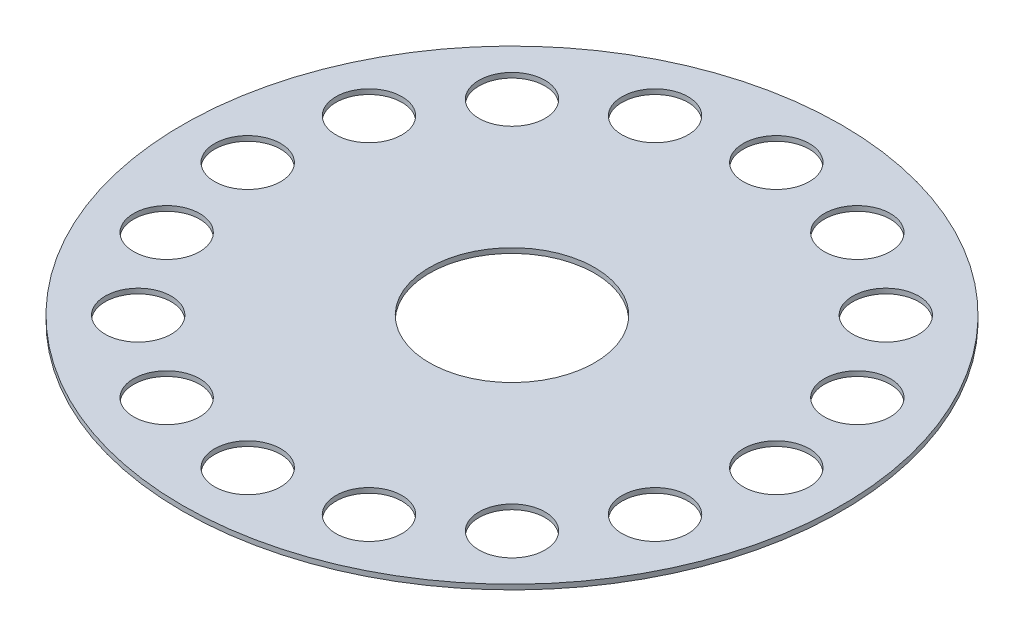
ISO-10303-21;
HEADER;
FILE_DESCRIPTION(('STEP AP214'),'2;1');
FILE_NAME('part.step','',(''),(''),'','','');
FILE_SCHEMA(('AUTOMOTIVE_DESIGN { 1 0 10303 214 1 1 1 1 }'));
ENDSEC;
DATA;
#1=APPLICATION_CONTEXT('core data for automotive mechanical design processes');
#2=APPLICATION_PROTOCOL_DEFINITION('international standard','automotive_design',2000,#1);
#3=PRODUCT_CONTEXT('',#1,'mechanical');
#4=PRODUCT('Part','Part','',(#3));
#5=PRODUCT_RELATED_PRODUCT_CATEGORY('part','',(#4));
#6=PRODUCT_DEFINITION_FORMATION('','',#4);
#7=PRODUCT_DEFINITION_CONTEXT('part definition',#1,'design');
#8=PRODUCT_DEFINITION('design','',#6,#7);
#9=PRODUCT_DEFINITION_SHAPE('','',#8);
#10=(LENGTH_UNIT() NAMED_UNIT(*) SI_UNIT(.MILLI.,.METRE.));
#11=(NAMED_UNIT(*) PLANE_ANGLE_UNIT() SI_UNIT($,.RADIAN.));
#12=(NAMED_UNIT(*) SI_UNIT($,.STERADIAN.) SOLID_ANGLE_UNIT());
#13=UNCERTAINTY_MEASURE_WITH_UNIT(LENGTH_MEASURE(1.E-05),#10,'distance_accuracy_value','');
#14=(GEOMETRIC_REPRESENTATION_CONTEXT(3) GLOBAL_UNCERTAINTY_ASSIGNED_CONTEXT((#13)) GLOBAL_UNIT_ASSIGNED_CONTEXT((#10,
#11,#12)) REPRESENTATION_CONTEXT('',''));
#15=CARTESIAN_POINT('',(0.,0.,0.));
#16=DIRECTION('',(0.,0.,1.));
#17=DIRECTION('',(1.,0.,0.));
#18=AXIS2_PLACEMENT_3D('',#15,#16,#17);
#19=CARTESIAN_POINT('',(0.,1.5,0.));
#20=DIRECTION('',(0.,-1.,0.));
#21=DIRECTION('',(0.,0.,-1.));
#22=AXIS2_PLACEMENT_3D('',#19,#20,#21);
#23=CYLINDRICAL_SURFACE('',#22,99.75);
#24=CARTESIAN_POINT('',(0.,1.5,0.));
#25=DIRECTION('',(0.,1.,0.));
#26=DIRECTION('',(0.,0.,1.));
#27=AXIS2_PLACEMENT_3D('',#24,#25,#26);
#28=CIRCLE('',#27,99.75);
#29=CARTESIAN_POINT('',(0.,1.5,99.75));
#30=VERTEX_POINT('',#29);
#31=EDGE_CURVE('E10',#30,#30,#28,.T.);
#32=ORIENTED_EDGE('',*,*,#31,.F.);
#33=EDGE_LOOP('',(#32));
#34=FACE_BOUND('',#33,.T.);
#35=CARTESIAN_POINT('',(0.,0.,0.));
#36=DIRECTION('',(0.,1.,0.));
#37=DIRECTION('',(0.,0.,1.));
#38=AXIS2_PLACEMENT_3D('',#35,#36,#37);
#39=CIRCLE('',#38,99.75);
#40=CARTESIAN_POINT('',(0.,0.,99.75));
#41=VERTEX_POINT('',#40);
#42=EDGE_CURVE('E34',#41,#41,#39,.T.);
#43=ORIENTED_EDGE('',*,*,#42,.T.);
#44=EDGE_LOOP('',(#43));
#45=FACE_BOUND('',#44,.T.);
#46=ADVANCED_FACE('F31',(#34,#45),#23,.T.);
#47=CARTESIAN_POINT('',(0.,1.5,0.));
#48=DIRECTION('',(0.,1.,0.));
#49=DIRECTION('',(0.,0.,1.));
#50=AXIS2_PLACEMENT_3D('',#47,#48,#49);
#51=PLANE('',#50);
#52=CARTESIAN_POINT('',(0.,1.5,0.));
#53=DIRECTION('',(0.,-1.,0.));
#54=DIRECTION('',(0.,0.,-1.));
#55=AXIS2_PLACEMENT_3D('',#52,#53,#54);
#56=CIRCLE('',#55,25.);
#57=CARTESIAN_POINT('',(0.,1.5,-25.));
#58=VERTEX_POINT('',#57);
#59=EDGE_CURVE('E107',#58,#58,#56,.T.);
#60=ORIENTED_EDGE('',*,*,#59,.T.);
#61=EDGE_LOOP('',(#60));
#62=FACE_BOUND('',#61,.T.);
#63=CARTESIAN_POINT('',(-56.5685424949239,1.5,-56.5685424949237));
#64=DIRECTION('',(0.,1.,0.));
#65=DIRECTION('',(0.707106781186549,0.,0.707106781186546));
#66=AXIS2_PLACEMENT_3D('',#63,#64,#65);
#67=CIRCLE('',#66,10.);
#68=CARTESIAN_POINT('',(-49.4974746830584,1.5,-49.4974746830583));
#69=VERTEX_POINT('',#68);
#70=EDGE_CURVE('E98',#69,#69,#67,.T.);
#71=ORIENTED_EDGE('',*,*,#70,.F.);
#72=EDGE_LOOP('',(#71));
#73=FACE_BOUND('',#72,.T.);
#74=CARTESIAN_POINT('',(-73.910362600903,1.5,-30.614674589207));
#75=DIRECTION('',(0.,1.,0.));
#76=DIRECTION('',(0.923879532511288,0.,0.382683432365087));
#77=AXIS2_PLACEMENT_3D('',#74,#75,#76);
#78=CIRCLE('',#77,10.);
#79=CARTESIAN_POINT('',(-64.6715672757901,1.5,-26.7878402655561));
#80=VERTEX_POINT('',#79);
#81=EDGE_CURVE('E92',#80,#80,#78,.T.);
#82=ORIENTED_EDGE('',*,*,#81,.F.);
#83=EDGE_LOOP('',(#82));
#84=FACE_BOUND('',#83,.T.);
#85=CARTESIAN_POINT('',(-80.,1.5,2.81767800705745E-13));
#86=DIRECTION('',(0.,1.,0.));
#87=DIRECTION('',(1.,0.,0.));
#88=AXIS2_PLACEMENT_3D('',#85,#86,#87);
#89=CIRCLE('',#88,10.);
#90=CARTESIAN_POINT('',(-70.,1.5,2.46852987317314E-13));
#91=VERTEX_POINT('',#90);
#92=EDGE_CURVE('E86',#91,#91,#89,.T.);
#93=ORIENTED_EDGE('',*,*,#92,.F.);
#94=EDGE_LOOP('',(#93));
#95=FACE_BOUND('',#94,.T.);
#96=CARTESIAN_POINT('',(-73.9103626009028,1.5,30.6146745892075));
#97=DIRECTION('',(0.,1.,0.));
#98=DIRECTION('',(0.923879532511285,0.,-0.382683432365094));
#99=AXIS2_PLACEMENT_3D('',#96,#97,#98);
#100=CIRCLE('',#99,10.);
#101=CARTESIAN_POINT('',(-64.67156727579,1.5,26.7878402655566));
#102=VERTEX_POINT('',#101);
#103=EDGE_CURVE('E80',#102,#102,#100,.T.);
#104=ORIENTED_EDGE('',*,*,#103,.F.);
#105=EDGE_LOOP('',(#104));
#106=FACE_BOUND('',#105,.T.);
#107=CARTESIAN_POINT('',(-56.5685424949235,1.5,56.5685424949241));
#108=DIRECTION('',(0.,1.,0.));
#109=DIRECTION('',(0.707106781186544,0.,-0.707106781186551));
#110=AXIS2_PLACEMENT_3D('',#107,#108,#109);
#111=CIRCLE('',#110,10.);
#112=CARTESIAN_POINT('',(-49.4974746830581,1.5,49.4974746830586));
#113=VERTEX_POINT('',#112);
#114=EDGE_CURVE('E74',#113,#113,#111,.T.);
#115=ORIENTED_EDGE('',*,*,#114,.F.);
#116=EDGE_LOOP('',(#115));
#117=FACE_BOUND('',#116,.T.);
#118=CARTESIAN_POINT('',(-30.6146745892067,1.5,73.9103626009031));
#119=DIRECTION('',(0.,1.,0.));
#120=DIRECTION('',(0.382683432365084,0.,-0.923879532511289));
#121=AXIS2_PLACEMENT_3D('',#118,#119,#120);
#122=CIRCLE('',#121,10.);
#123=CARTESIAN_POINT('',(-26.7878402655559,1.5,64.6715672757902));
#124=VERTEX_POINT('',#123);
#125=EDGE_CURVE('E68',#124,#124,#122,.T.);
#126=ORIENTED_EDGE('',*,*,#125,.F.);
#127=EDGE_LOOP('',(#126));
#128=FACE_BOUND('',#127,.T.);
#129=CARTESIAN_POINT('',(0.,1.5,80.));
#130=DIRECTION('',(0.,1.,0.));
#131=DIRECTION('',(0.,0.,-1.));
#132=AXIS2_PLACEMENT_3D('',#129,#130,#131);
#133=CIRCLE('',#132,10.);
#134=CARTESIAN_POINT('',(0.,1.5,70.));
#135=VERTEX_POINT('',#134);
#136=EDGE_CURVE('E62',#135,#135,#133,.T.);
#137=ORIENTED_EDGE('',*,*,#136,.F.);
#138=EDGE_LOOP('',(#137));
#139=FACE_BOUND('',#138,.T.);
#140=CARTESIAN_POINT('',(30.6146745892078,1.5,73.9103626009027));
#141=DIRECTION('',(0.,1.,0.));
#142=DIRECTION('',(-0.382683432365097,0.,-0.923879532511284));
#143=AXIS2_PLACEMENT_3D('',#140,#141,#142);
#144=CIRCLE('',#143,10.);
#145=CARTESIAN_POINT('',(26.7878402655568,1.5,64.6715672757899));
#146=VERTEX_POINT('',#145);
#147=EDGE_CURVE('E55',#146,#146,#144,.T.);
#148=ORIENTED_EDGE('',*,*,#147,.F.);
#149=EDGE_LOOP('',(#148));
#150=FACE_BOUND('',#149,.T.);
#151=CARTESIAN_POINT('',(56.5685424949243,1.5,56.5685424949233));
#152=DIRECTION('',(0.,1.,0.));
#153=DIRECTION('',(-0.707106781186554,0.,-0.707106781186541));
#154=AXIS2_PLACEMENT_3D('',#151,#152,#153);
#155=CIRCLE('',#154,10.);
#156=CARTESIAN_POINT('',(49.4974746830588,1.5,49.4974746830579));
#157=VERTEX_POINT('',#156);
#158=EDGE_CURVE('E134',#157,#157,#155,.T.);
#159=ORIENTED_EDGE('',*,*,#158,.F.);
#160=EDGE_LOOP('',(#159));
#161=FACE_BOUND('',#160,.T.);
#162=CARTESIAN_POINT('',(73.9103626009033,1.5,30.6146745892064));
#163=DIRECTION('',(0.,1.,0.));
#164=DIRECTION('',(-0.923879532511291,0.,-0.382683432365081));
#165=AXIS2_PLACEMENT_3D('',#162,#163,#164);
#166=CIRCLE('',#165,10.);
#167=CARTESIAN_POINT('',(64.6715672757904,1.5,26.7878402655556));
#168=VERTEX_POINT('',#167);
#169=EDGE_CURVE('E128',#168,#168,#166,.T.);
#170=ORIENTED_EDGE('',*,*,#169,.F.);
#171=EDGE_LOOP('',(#170));
#172=FACE_BOUND('',#171,.T.);
#173=CARTESIAN_POINT('',(80.,1.5,-8.40404814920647E-13));
#174=DIRECTION('',(0.,1.,0.));
#175=DIRECTION('',(-1.,0.,0.));
#176=AXIS2_PLACEMENT_3D('',#173,#174,#175);
#177=CIRCLE('',#176,10.);
#178=CARTESIAN_POINT('',(70.,1.5,-7.35660374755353E-13));
#179=VERTEX_POINT('',#178);
#180=EDGE_CURVE('E122',#179,#179,#177,.T.);
#181=ORIENTED_EDGE('',*,*,#180,.F.);
#182=EDGE_LOOP('',(#181));
#183=FACE_BOUND('',#182,.T.);
#184=CARTESIAN_POINT('',(73.9103626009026,1.5,-30.614674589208));
#185=DIRECTION('',(0.,1.,0.));
#186=DIRECTION('',(-0.923879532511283,0.,0.3826834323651));
#187=AXIS2_PLACEMENT_3D('',#184,#185,#186);
#188=CIRCLE('',#187,10.);
#189=CARTESIAN_POINT('',(64.6715672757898,1.5,-26.787840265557));
#190=VERTEX_POINT('',#189);
#191=EDGE_CURVE('E116',#190,#190,#188,.T.);
#192=ORIENTED_EDGE('',*,*,#191,.F.);
#193=EDGE_LOOP('',(#192));
#194=FACE_BOUND('',#193,.T.);
#195=CARTESIAN_POINT('',(56.5685424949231,1.5,-56.5685424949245));
#196=DIRECTION('',(0.,1.,0.));
#197=DIRECTION('',(-0.707106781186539,0.,0.707106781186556));
#198=AXIS2_PLACEMENT_3D('',#195,#196,#197);
#199=CIRCLE('',#198,10.);
#200=CARTESIAN_POINT('',(49.4974746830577,1.5,-49.4974746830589));
#201=VERTEX_POINT('',#200);
#202=EDGE_CURVE('E110',#201,#201,#199,.T.);
#203=ORIENTED_EDGE('',*,*,#202,.F.);
#204=EDGE_LOOP('',(#203));
#205=FACE_BOUND('',#204,.T.);
#206=CARTESIAN_POINT('',(30.6146745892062,1.5,-73.9103626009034));
#207=DIRECTION('',(0.,1.,0.));
#208=DIRECTION('',(-0.382683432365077,0.,0.923879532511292));
#209=AXIS2_PLACEMENT_3D('',#206,#207,#208);
#210=CIRCLE('',#209,10.);
#211=CARTESIAN_POINT('',(26.7878402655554,1.5,-64.6715672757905));
#212=VERTEX_POINT('',#211);
#213=EDGE_CURVE('E103',#212,#212,#210,.T.);
#214=ORIENTED_EDGE('',*,*,#213,.F.);
#215=EDGE_LOOP('',(#214));
#216=FACE_BOUND('',#215,.T.);
#217=CARTESIAN_POINT('',(-30.6146745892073,1.5,-73.9103626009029));
#218=DIRECTION('',(0.,1.,0.));
#219=DIRECTION('',(0.382683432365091,0.,0.923879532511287));
#220=AXIS2_PLACEMENT_3D('',#217,#218,#219);
#221=CIRCLE('',#220,10.);
#222=CARTESIAN_POINT('',(-26.7878402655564,1.5,-64.6715672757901));
#223=VERTEX_POINT('',#222);
#224=EDGE_CURVE('E49',#223,#223,#221,.T.);
#225=ORIENTED_EDGE('',*,*,#224,.F.);
#226=EDGE_LOOP('',(#225));
#227=FACE_BOUND('',#226,.T.);
#228=CARTESIAN_POINT('',(0.,1.5,-80.));
#229=DIRECTION('',(0.,1.,0.));
#230=DIRECTION('',(0.,0.,1.));
#231=AXIS2_PLACEMENT_3D('',#228,#229,#230);
#232=CIRCLE('',#231,10.);
#233=CARTESIAN_POINT('',(0.,1.5,-70.));
#234=VERTEX_POINT('',#233);
#235=EDGE_CURVE('E43',#234,#234,#232,.T.);
#236=ORIENTED_EDGE('',*,*,#235,.F.);
#237=EDGE_LOOP('',(#236));
#238=FACE_BOUND('',#237,.T.);
#239=ORIENTED_EDGE('',*,*,#31,.T.);
#240=EDGE_LOOP('',(#239));
#241=FACE_BOUND('',#240,.T.);
#242=ADVANCED_FACE('F145',(#62,#73,#84,#95,#106,#117,#128,#139,#150,#161,#172,#183,#194,#205,
#216,#227,#238,#241),#51,.T.);
#243=CARTESIAN_POINT('',(0.,0.,0.));
#244=DIRECTION('',(0.,1.,0.));
#245=DIRECTION('',(0.,0.,1.));
#246=AXIS2_PLACEMENT_3D('',#243,#244,#245);
#247=PLANE('',#246);
#248=CARTESIAN_POINT('',(0.,0.,0.));
#249=DIRECTION('',(0.,-1.,0.));
#250=DIRECTION('',(0.,0.,-1.));
#251=AXIS2_PLACEMENT_3D('',#248,#249,#250);
#252=CIRCLE('',#251,25.);
#253=CARTESIAN_POINT('',(0.,0.,-25.));
#254=VERTEX_POINT('',#253);
#255=EDGE_CURVE('E139',#254,#254,#252,.T.);
#256=ORIENTED_EDGE('',*,*,#255,.F.);
#257=EDGE_LOOP('',(#256));
#258=FACE_BOUND('',#257,.T.);
#259=CARTESIAN_POINT('',(-56.5685424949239,0.,-56.5685424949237));
#260=DIRECTION('',(0.,1.,0.));
#261=DIRECTION('',(0.707106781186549,0.,0.707106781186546));
#262=AXIS2_PLACEMENT_3D('',#259,#260,#261);
#263=CIRCLE('',#262,10.);
#264=CARTESIAN_POINT('',(-49.4974746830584,0.,-49.4974746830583));
#265=VERTEX_POINT('',#264);
#266=EDGE_CURVE('E52',#265,#265,#263,.T.);
#267=ORIENTED_EDGE('',*,*,#266,.T.);
#268=EDGE_LOOP('',(#267));
#269=FACE_BOUND('',#268,.T.);
#270=CARTESIAN_POINT('',(-73.910362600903,0.,-30.614674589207));
#271=DIRECTION('',(0.,1.,0.));
#272=DIRECTION('',(0.923879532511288,0.,0.382683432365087));
#273=AXIS2_PLACEMENT_3D('',#270,#271,#272);
#274=CIRCLE('',#273,10.);
#275=CARTESIAN_POINT('',(-64.6715672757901,0.,-26.7878402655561));
#276=VERTEX_POINT('',#275);
#277=EDGE_CURVE('E95',#276,#276,#274,.T.);
#278=ORIENTED_EDGE('',*,*,#277,.T.);
#279=EDGE_LOOP('',(#278));
#280=FACE_BOUND('',#279,.T.);
#281=CARTESIAN_POINT('',(-80.,0.,2.81767800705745E-13));
#282=DIRECTION('',(0.,1.,0.));
#283=DIRECTION('',(1.,0.,0.));
#284=AXIS2_PLACEMENT_3D('',#281,#282,#283);
#285=CIRCLE('',#284,10.);
#286=CARTESIAN_POINT('',(-70.,0.,2.46852987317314E-13));
#287=VERTEX_POINT('',#286);
#288=EDGE_CURVE('E89',#287,#287,#285,.T.);
#289=ORIENTED_EDGE('',*,*,#288,.T.);
#290=EDGE_LOOP('',(#289));
#291=FACE_BOUND('',#290,.T.);
#292=CARTESIAN_POINT('',(-73.9103626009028,0.,30.6146745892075));
#293=DIRECTION('',(0.,1.,0.));
#294=DIRECTION('',(0.923879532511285,0.,-0.382683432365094));
#295=AXIS2_PLACEMENT_3D('',#292,#293,#294);
#296=CIRCLE('',#295,10.);
#297=CARTESIAN_POINT('',(-64.67156727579,0.,26.7878402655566));
#298=VERTEX_POINT('',#297);
#299=EDGE_CURVE('E83',#298,#298,#296,.T.);
#300=ORIENTED_EDGE('',*,*,#299,.T.);
#301=EDGE_LOOP('',(#300));
#302=FACE_BOUND('',#301,.T.);
#303=CARTESIAN_POINT('',(-56.5685424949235,0.,56.5685424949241));
#304=DIRECTION('',(0.,1.,0.));
#305=DIRECTION('',(0.707106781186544,0.,-0.707106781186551));
#306=AXIS2_PLACEMENT_3D('',#303,#304,#305);
#307=CIRCLE('',#306,10.);
#308=CARTESIAN_POINT('',(-49.4974746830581,0.,49.4974746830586));
#309=VERTEX_POINT('',#308);
#310=EDGE_CURVE('E77',#309,#309,#307,.T.);
#311=ORIENTED_EDGE('',*,*,#310,.T.);
#312=EDGE_LOOP('',(#311));
#313=FACE_BOUND('',#312,.T.);
#314=CARTESIAN_POINT('',(-30.6146745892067,0.,73.9103626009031));
#315=DIRECTION('',(0.,1.,0.));
#316=DIRECTION('',(0.382683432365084,0.,-0.923879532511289));
#317=AXIS2_PLACEMENT_3D('',#314,#315,#316);
#318=CIRCLE('',#317,10.);
#319=CARTESIAN_POINT('',(-26.7878402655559,0.,64.6715672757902));
#320=VERTEX_POINT('',#319);
#321=EDGE_CURVE('E71',#320,#320,#318,.T.);
#322=ORIENTED_EDGE('',*,*,#321,.T.);
#323=EDGE_LOOP('',(#322));
#324=FACE_BOUND('',#323,.T.);
#325=CARTESIAN_POINT('',(0.,0.,80.));
#326=DIRECTION('',(0.,1.,0.));
#327=DIRECTION('',(0.,0.,-1.));
#328=AXIS2_PLACEMENT_3D('',#325,#326,#327);
#329=CIRCLE('',#328,10.);
#330=CARTESIAN_POINT('',(0.,0.,70.));
#331=VERTEX_POINT('',#330);
#332=EDGE_CURVE('E65',#331,#331,#329,.T.);
#333=ORIENTED_EDGE('',*,*,#332,.T.);
#334=EDGE_LOOP('',(#333));
#335=FACE_BOUND('',#334,.T.);
#336=CARTESIAN_POINT('',(30.6146745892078,0.,73.9103626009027));
#337=DIRECTION('',(0.,1.,0.));
#338=DIRECTION('',(-0.382683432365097,0.,-0.923879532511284));
#339=AXIS2_PLACEMENT_3D('',#336,#337,#338);
#340=CIRCLE('',#339,10.);
#341=CARTESIAN_POINT('',(26.7878402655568,0.,64.6715672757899));
#342=VERTEX_POINT('',#341);
#343=EDGE_CURVE('E58',#342,#342,#340,.T.);
#344=ORIENTED_EDGE('',*,*,#343,.T.);
#345=EDGE_LOOP('',(#344));
#346=FACE_BOUND('',#345,.T.);
#347=CARTESIAN_POINT('',(56.5685424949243,0.,56.5685424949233));
#348=DIRECTION('',(0.,1.,0.));
#349=DIRECTION('',(-0.707106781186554,0.,-0.707106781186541));
#350=AXIS2_PLACEMENT_3D('',#347,#348,#349);
#351=CIRCLE('',#350,10.);
#352=CARTESIAN_POINT('',(49.4974746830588,0.,49.4974746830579));
#353=VERTEX_POINT('',#352);
#354=EDGE_CURVE('E59',#353,#353,#351,.T.);
#355=ORIENTED_EDGE('',*,*,#354,.T.);
#356=EDGE_LOOP('',(#355));
#357=FACE_BOUND('',#356,.T.);
#358=CARTESIAN_POINT('',(73.9103626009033,0.,30.6146745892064));
#359=DIRECTION('',(0.,1.,0.));
#360=DIRECTION('',(-0.923879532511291,0.,-0.382683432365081));
#361=AXIS2_PLACEMENT_3D('',#358,#359,#360);
#362=CIRCLE('',#361,10.);
#363=CARTESIAN_POINT('',(64.6715672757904,0.,26.7878402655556));
#364=VERTEX_POINT('',#363);
#365=EDGE_CURVE('E131',#364,#364,#362,.T.);
#366=ORIENTED_EDGE('',*,*,#365,.T.);
#367=EDGE_LOOP('',(#366));
#368=FACE_BOUND('',#367,.T.);
#369=CARTESIAN_POINT('',(80.,0.,-8.40404814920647E-13));
#370=DIRECTION('',(0.,1.,0.));
#371=DIRECTION('',(-1.,0.,0.));
#372=AXIS2_PLACEMENT_3D('',#369,#370,#371);
#373=CIRCLE('',#372,10.);
#374=CARTESIAN_POINT('',(70.,0.,-7.35660374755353E-13));
#375=VERTEX_POINT('',#374);
#376=EDGE_CURVE('E125',#375,#375,#373,.T.);
#377=ORIENTED_EDGE('',*,*,#376,.T.);
#378=EDGE_LOOP('',(#377));
#379=FACE_BOUND('',#378,.T.);
#380=CARTESIAN_POINT('',(73.9103626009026,0.,-30.614674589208));
#381=DIRECTION('',(0.,1.,0.));
#382=DIRECTION('',(-0.923879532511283,0.,0.3826834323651));
#383=AXIS2_PLACEMENT_3D('',#380,#381,#382);
#384=CIRCLE('',#383,10.);
#385=CARTESIAN_POINT('',(64.6715672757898,0.,-26.787840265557));
#386=VERTEX_POINT('',#385);
#387=EDGE_CURVE('E119',#386,#386,#384,.T.);
#388=ORIENTED_EDGE('',*,*,#387,.T.);
#389=EDGE_LOOP('',(#388));
#390=FACE_BOUND('',#389,.T.);
#391=CARTESIAN_POINT('',(56.5685424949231,0.,-56.5685424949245));
#392=DIRECTION('',(0.,1.,0.));
#393=DIRECTION('',(-0.707106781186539,0.,0.707106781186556));
#394=AXIS2_PLACEMENT_3D('',#391,#392,#393);
#395=CIRCLE('',#394,10.);
#396=CARTESIAN_POINT('',(49.4974746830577,0.,-49.4974746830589));
#397=VERTEX_POINT('',#396);
#398=EDGE_CURVE('E113',#397,#397,#395,.T.);
#399=ORIENTED_EDGE('',*,*,#398,.T.);
#400=EDGE_LOOP('',(#399));
#401=FACE_BOUND('',#400,.T.);
#402=CARTESIAN_POINT('',(30.6146745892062,0.,-73.9103626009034));
#403=DIRECTION('',(0.,1.,0.));
#404=DIRECTION('',(-0.382683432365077,0.,0.923879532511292));
#405=AXIS2_PLACEMENT_3D('',#402,#403,#404);
#406=CIRCLE('',#405,10.);
#407=CARTESIAN_POINT('',(26.7878402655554,0.,-64.6715672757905));
#408=VERTEX_POINT('',#407);
#409=EDGE_CURVE('E106',#408,#408,#406,.T.);
#410=ORIENTED_EDGE('',*,*,#409,.T.);
#411=EDGE_LOOP('',(#410));
#412=FACE_BOUND('',#411,.T.);
#413=CARTESIAN_POINT('',(-30.6146745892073,0.,-73.9103626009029));
#414=DIRECTION('',(0.,1.,0.));
#415=DIRECTION('',(0.382683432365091,0.,0.923879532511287));
#416=AXIS2_PLACEMENT_3D('',#413,#414,#415);
#417=CIRCLE('',#416,10.);
#418=CARTESIAN_POINT('',(-26.7878402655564,0.,-64.6715672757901));
#419=VERTEX_POINT('',#418);
#420=EDGE_CURVE('E46',#419,#419,#417,.T.);
#421=ORIENTED_EDGE('',*,*,#420,.T.);
#422=EDGE_LOOP('',(#421));
#423=FACE_BOUND('',#422,.T.);
#424=CARTESIAN_POINT('',(0.,0.,-80.));
#425=DIRECTION('',(0.,1.,0.));
#426=DIRECTION('',(0.,0.,1.));
#427=AXIS2_PLACEMENT_3D('',#424,#425,#426);
#428=CIRCLE('',#427,10.);
#429=CARTESIAN_POINT('',(0.,0.,-70.));
#430=VERTEX_POINT('',#429);
#431=EDGE_CURVE('E41',#430,#430,#428,.T.);
#432=ORIENTED_EDGE('',*,*,#431,.T.);
#433=EDGE_LOOP('',(#432));
#434=FACE_BOUND('',#433,.T.);
#435=ORIENTED_EDGE('',*,*,#42,.F.);
#436=EDGE_LOOP('',(#435));
#437=FACE_BOUND('',#436,.T.);
#438=ADVANCED_FACE('F155',(#258,#269,#280,#291,#302,#313,#324,#335,#346,#357,#368,#379,#390,
#401,#412,#423,#434,#437),#247,.F.);
#439=CARTESIAN_POINT('',(0.,0.,-80.));
#440=DIRECTION('',(0.,1.,0.));
#441=DIRECTION('',(0.,0.,1.));
#442=AXIS2_PLACEMENT_3D('',#439,#440,#441);
#443=CYLINDRICAL_SURFACE('',#442,10.);
#444=ORIENTED_EDGE('',*,*,#431,.F.);
#445=EDGE_LOOP('',(#444));
#446=FACE_BOUND('',#445,.T.);
#447=ORIENTED_EDGE('',*,*,#235,.T.);
#448=EDGE_LOOP('',(#447));
#449=FACE_BOUND('',#448,.T.);
#450=ADVANCED_FACE('F158',(#446,#449),#443,.F.);
#451=CARTESIAN_POINT('',(-30.6146745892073,0.,-73.9103626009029));
#452=DIRECTION('',(0.,1.,0.));
#453=DIRECTION('',(0.,0.,1.));
#454=AXIS2_PLACEMENT_3D('',#451,#452,#453);
#455=CYLINDRICAL_SURFACE('',#454,10.);
#456=ORIENTED_EDGE('',*,*,#420,.F.);
#457=EDGE_LOOP('',(#456));
#458=FACE_BOUND('',#457,.T.);
#459=ORIENTED_EDGE('',*,*,#224,.T.);
#460=EDGE_LOOP('',(#459));
#461=FACE_BOUND('',#460,.T.);
#462=ADVANCED_FACE('F204',(#458,#461),#455,.F.);
#463=CARTESIAN_POINT('',(30.6146745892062,0.,-73.9103626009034));
#464=DIRECTION('',(0.,1.,0.));
#465=DIRECTION('',(0.,0.,1.));
#466=AXIS2_PLACEMENT_3D('',#463,#464,#465);
#467=CYLINDRICAL_SURFACE('',#466,10.);
#468=ORIENTED_EDGE('',*,*,#409,.F.);
#469=EDGE_LOOP('',(#468));
#470=FACE_BOUND('',#469,.T.);
#471=ORIENTED_EDGE('',*,*,#213,.T.);
#472=EDGE_LOOP('',(#471));
#473=FACE_BOUND('',#472,.T.);
#474=ADVANCED_FACE('F208',(#470,#473),#467,.F.);
#475=CARTESIAN_POINT('',(56.5685424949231,0.,-56.5685424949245));
#476=DIRECTION('',(0.,1.,0.));
#477=DIRECTION('',(0.,0.,1.));
#478=AXIS2_PLACEMENT_3D('',#475,#476,#477);
#479=CYLINDRICAL_SURFACE('',#478,10.);
#480=ORIENTED_EDGE('',*,*,#398,.F.);
#481=EDGE_LOOP('',(#480));
#482=FACE_BOUND('',#481,.T.);
#483=ORIENTED_EDGE('',*,*,#202,.T.);
#484=EDGE_LOOP('',(#483));
#485=FACE_BOUND('',#484,.T.);
#486=ADVANCED_FACE('F244',(#482,#485),#479,.F.);
#487=CARTESIAN_POINT('',(73.9103626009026,0.,-30.614674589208));
#488=DIRECTION('',(0.,1.,0.));
#489=DIRECTION('',(0.,0.,1.));
#490=AXIS2_PLACEMENT_3D('',#487,#488,#489);
#491=CYLINDRICAL_SURFACE('',#490,10.);
#492=ORIENTED_EDGE('',*,*,#387,.F.);
#493=EDGE_LOOP('',(#492));
#494=FACE_BOUND('',#493,.T.);
#495=ORIENTED_EDGE('',*,*,#191,.T.);
#496=EDGE_LOOP('',(#495));
#497=FACE_BOUND('',#496,.T.);
#498=ADVANCED_FACE('F248',(#494,#497),#491,.F.);
#499=CARTESIAN_POINT('',(80.,0.,-8.40404814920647E-13));
#500=DIRECTION('',(0.,1.,0.));
#501=DIRECTION('',(0.,0.,1.));
#502=AXIS2_PLACEMENT_3D('',#499,#500,#501);
#503=CYLINDRICAL_SURFACE('',#502,10.);
#504=ORIENTED_EDGE('',*,*,#376,.F.);
#505=EDGE_LOOP('',(#504));
#506=FACE_BOUND('',#505,.T.);
#507=ORIENTED_EDGE('',*,*,#180,.T.);
#508=EDGE_LOOP('',(#507));
#509=FACE_BOUND('',#508,.T.);
#510=ADVANCED_FACE('F252',(#506,#509),#503,.F.);
#511=CARTESIAN_POINT('',(73.9103626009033,0.,30.6146745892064));
#512=DIRECTION('',(0.,1.,0.));
#513=DIRECTION('',(0.,0.,1.));
#514=AXIS2_PLACEMENT_3D('',#511,#512,#513);
#515=CYLINDRICAL_SURFACE('',#514,10.);
#516=ORIENTED_EDGE('',*,*,#365,.F.);
#517=EDGE_LOOP('',(#516));
#518=FACE_BOUND('',#517,.T.);
#519=ORIENTED_EDGE('',*,*,#169,.T.);
#520=EDGE_LOOP('',(#519));
#521=FACE_BOUND('',#520,.T.);
#522=ADVANCED_FACE('F256',(#518,#521),#515,.F.);
#523=CARTESIAN_POINT('',(56.5685424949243,0.,56.5685424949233));
#524=DIRECTION('',(0.,1.,0.));
#525=DIRECTION('',(0.,0.,1.));
#526=AXIS2_PLACEMENT_3D('',#523,#524,#525);
#527=CYLINDRICAL_SURFACE('',#526,10.);
#528=ORIENTED_EDGE('',*,*,#354,.F.);
#529=EDGE_LOOP('',(#528));
#530=FACE_BOUND('',#529,.T.);
#531=ORIENTED_EDGE('',*,*,#158,.T.);
#532=EDGE_LOOP('',(#531));
#533=FACE_BOUND('',#532,.T.);
#534=ADVANCED_FACE('F214',(#530,#533),#527,.F.);
#535=CARTESIAN_POINT('',(30.6146745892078,0.,73.9103626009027));
#536=DIRECTION('',(0.,1.,0.));
#537=DIRECTION('',(0.,0.,1.));
#538=AXIS2_PLACEMENT_3D('',#535,#536,#537);
#539=CYLINDRICAL_SURFACE('',#538,10.);
#540=ORIENTED_EDGE('',*,*,#343,.F.);
#541=EDGE_LOOP('',(#540));
#542=FACE_BOUND('',#541,.T.);
#543=ORIENTED_EDGE('',*,*,#147,.T.);
#544=EDGE_LOOP('',(#543));
#545=FACE_BOUND('',#544,.T.);
#546=ADVANCED_FACE('F210',(#542,#545),#539,.F.);
#547=CARTESIAN_POINT('',(0.,0.,80.));
#548=DIRECTION('',(0.,1.,0.));
#549=DIRECTION('',(0.,0.,1.));
#550=AXIS2_PLACEMENT_3D('',#547,#548,#549);
#551=CYLINDRICAL_SURFACE('',#550,10.);
#552=ORIENTED_EDGE('',*,*,#332,.F.);
#553=EDGE_LOOP('',(#552));
#554=FACE_BOUND('',#553,.T.);
#555=ORIENTED_EDGE('',*,*,#136,.T.);
#556=EDGE_LOOP('',(#555));
#557=FACE_BOUND('',#556,.T.);
#558=ADVANCED_FACE('F213',(#554,#557),#551,.F.);
#559=CARTESIAN_POINT('',(-30.6146745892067,0.,73.9103626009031));
#560=DIRECTION('',(0.,1.,0.));
#561=DIRECTION('',(0.,0.,1.));
#562=AXIS2_PLACEMENT_3D('',#559,#560,#561);
#563=CYLINDRICAL_SURFACE('',#562,10.);
#564=ORIENTED_EDGE('',*,*,#321,.F.);
#565=EDGE_LOOP('',(#564));
#566=FACE_BOUND('',#565,.T.);
#567=ORIENTED_EDGE('',*,*,#125,.T.);
#568=EDGE_LOOP('',(#567));
#569=FACE_BOUND('',#568,.T.);
#570=ADVANCED_FACE('F218',(#566,#569),#563,.F.);
#571=CARTESIAN_POINT('',(-56.5685424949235,0.,56.5685424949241));
#572=DIRECTION('',(0.,1.,0.));
#573=DIRECTION('',(0.,0.,1.));
#574=AXIS2_PLACEMENT_3D('',#571,#572,#573);
#575=CYLINDRICAL_SURFACE('',#574,10.);
#576=ORIENTED_EDGE('',*,*,#310,.F.);
#577=EDGE_LOOP('',(#576));
#578=FACE_BOUND('',#577,.T.);
#579=ORIENTED_EDGE('',*,*,#114,.T.);
#580=EDGE_LOOP('',(#579));
#581=FACE_BOUND('',#580,.T.);
#582=ADVANCED_FACE('F222',(#578,#581),#575,.F.);
#583=CARTESIAN_POINT('',(-73.9103626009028,0.,30.6146745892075));
#584=DIRECTION('',(0.,1.,0.));
#585=DIRECTION('',(0.,0.,1.));
#586=AXIS2_PLACEMENT_3D('',#583,#584,#585);
#587=CYLINDRICAL_SURFACE('',#586,10.);
#588=ORIENTED_EDGE('',*,*,#299,.F.);
#589=EDGE_LOOP('',(#588));
#590=FACE_BOUND('',#589,.T.);
#591=ORIENTED_EDGE('',*,*,#103,.T.);
#592=EDGE_LOOP('',(#591));
#593=FACE_BOUND('',#592,.T.);
#594=ADVANCED_FACE('F226',(#590,#593),#587,.F.);
#595=CARTESIAN_POINT('',(-80.,0.,2.81767800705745E-13));
#596=DIRECTION('',(0.,1.,0.));
#597=DIRECTION('',(0.,0.,1.));
#598=AXIS2_PLACEMENT_3D('',#595,#596,#597);
#599=CYLINDRICAL_SURFACE('',#598,10.);
#600=ORIENTED_EDGE('',*,*,#288,.F.);
#601=EDGE_LOOP('',(#600));
#602=FACE_BOUND('',#601,.T.);
#603=ORIENTED_EDGE('',*,*,#92,.T.);
#604=EDGE_LOOP('',(#603));
#605=FACE_BOUND('',#604,.T.);
#606=ADVANCED_FACE('F230',(#602,#605),#599,.F.);
#607=CARTESIAN_POINT('',(-73.910362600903,0.,-30.614674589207));
#608=DIRECTION('',(0.,1.,0.));
#609=DIRECTION('',(0.,0.,1.));
#610=AXIS2_PLACEMENT_3D('',#607,#608,#609);
#611=CYLINDRICAL_SURFACE('',#610,10.);
#612=ORIENTED_EDGE('',*,*,#277,.F.);
#613=EDGE_LOOP('',(#612));
#614=FACE_BOUND('',#613,.T.);
#615=ORIENTED_EDGE('',*,*,#81,.T.);
#616=EDGE_LOOP('',(#615));
#617=FACE_BOUND('',#616,.T.);
#618=ADVANCED_FACE('F234',(#614,#617),#611,.F.);
#619=CARTESIAN_POINT('',(-56.5685424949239,0.,-56.5685424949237));
#620=DIRECTION('',(0.,1.,0.));
#621=DIRECTION('',(0.,0.,1.));
#622=AXIS2_PLACEMENT_3D('',#619,#620,#621);
#623=CYLINDRICAL_SURFACE('',#622,10.);
#624=ORIENTED_EDGE('',*,*,#266,.F.);
#625=EDGE_LOOP('',(#624));
#626=FACE_BOUND('',#625,.T.);
#627=ORIENTED_EDGE('',*,*,#70,.T.);
#628=EDGE_LOOP('',(#627));
#629=FACE_BOUND('',#628,.T.);
#630=ADVANCED_FACE('F151',(#626,#629),#623,.F.);
#631=CARTESIAN_POINT('',(0.,1.5,0.));
#632=DIRECTION('',(0.,-1.,0.));
#633=DIRECTION('',(0.,0.,-1.));
#634=AXIS2_PLACEMENT_3D('',#631,#632,#633);
#635=CYLINDRICAL_SURFACE('',#634,25.);
#636=ORIENTED_EDGE('',*,*,#59,.F.);
#637=EDGE_LOOP('',(#636));
#638=FACE_BOUND('',#637,.T.);
#639=ORIENTED_EDGE('',*,*,#255,.T.);
#640=EDGE_LOOP('',(#639));
#641=FACE_BOUND('',#640,.T.);
#642=ADVANCED_FACE('F148',(#638,#641),#635,.F.);
#643=CLOSED_SHELL('',(#46,#242,#438,#450,#462,#474,#486,#498,#510,#522,#534,#546,#558,#570,#582,
#594,#606,#618,#630,#642));
#644=MANIFOLD_SOLID_BREP('B2',#643);
#645=ADVANCED_BREP_SHAPE_REPRESENTATION('',(#18,#644),#14);
#646=SHAPE_DEFINITION_REPRESENTATION(#9,#645);
ENDSEC;
END-ISO-10303-21;
